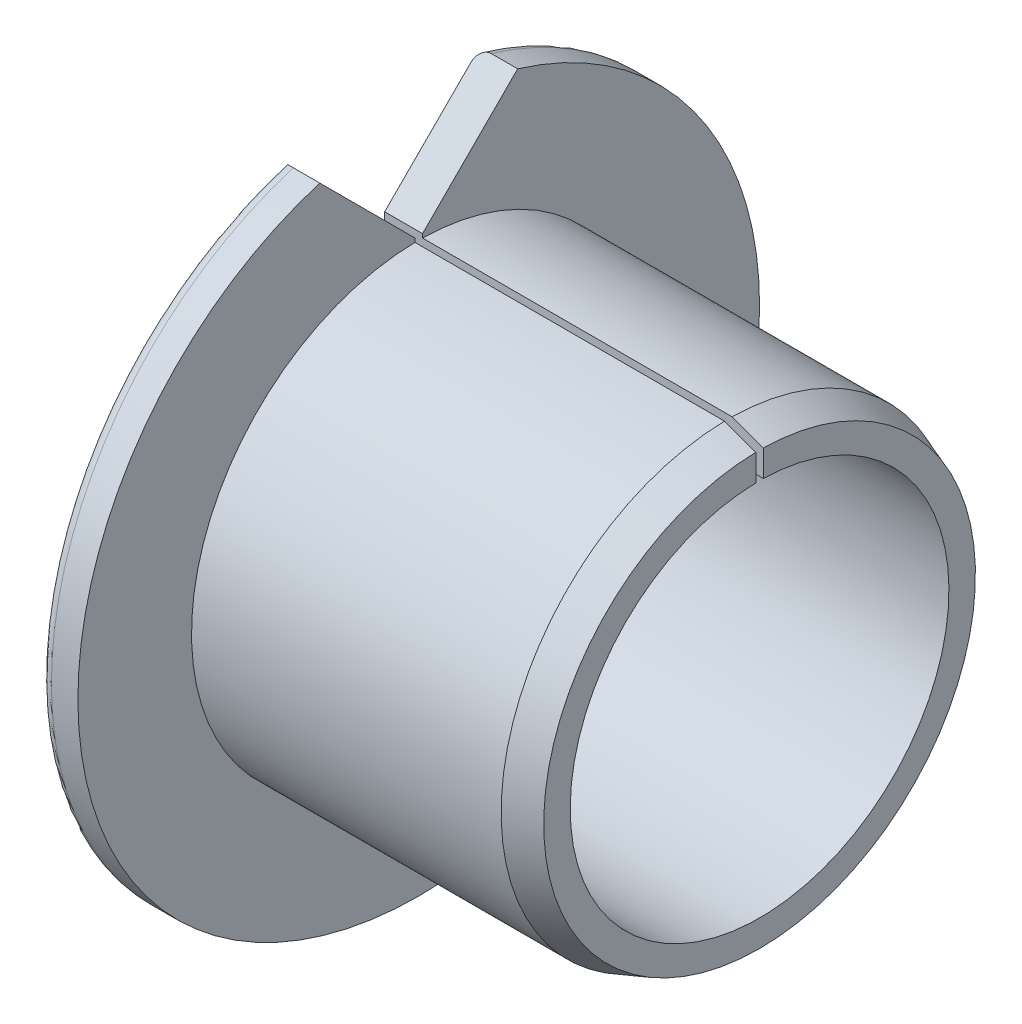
ISO-10303-21;
HEADER;
FILE_DESCRIPTION(('STEP AP214'),'2;1');
FILE_NAME('part.step','',(''),(''),'','','');
FILE_SCHEMA(('AUTOMOTIVE_DESIGN { 1 0 10303 214 1 1 1 1 }'));
ENDSEC;
DATA;
#1=APPLICATION_CONTEXT('core data for automotive mechanical design processes');
#2=APPLICATION_PROTOCOL_DEFINITION('international standard','automotive_design',2000,#1);
#3=PRODUCT_CONTEXT('',#1,'mechanical');
#4=PRODUCT('Part','Part','',(#3));
#5=PRODUCT_RELATED_PRODUCT_CATEGORY('part','',(#4));
#6=PRODUCT_DEFINITION_FORMATION('','',#4);
#7=PRODUCT_DEFINITION_CONTEXT('part definition',#1,'design');
#8=PRODUCT_DEFINITION('design','',#6,#7);
#9=PRODUCT_DEFINITION_SHAPE('','',#8);
#10=(LENGTH_UNIT() NAMED_UNIT(*) SI_UNIT(.MILLI.,.METRE.));
#11=(NAMED_UNIT(*) PLANE_ANGLE_UNIT() SI_UNIT($,.RADIAN.));
#12=(NAMED_UNIT(*) SI_UNIT($,.STERADIAN.) SOLID_ANGLE_UNIT());
#13=UNCERTAINTY_MEASURE_WITH_UNIT(LENGTH_MEASURE(1.E-05),#10,'distance_accuracy_value','');
#14=(GEOMETRIC_REPRESENTATION_CONTEXT(3) GLOBAL_UNCERTAINTY_ASSIGNED_CONTEXT((#13)) GLOBAL_UNIT_ASSIGNED_CONTEXT((#10,
#11,#12)) REPRESENTATION_CONTEXT('',''));
#15=CARTESIAN_POINT('',(0.,0.,0.));
#16=DIRECTION('',(0.,0.,1.));
#17=DIRECTION('',(1.,0.,0.));
#18=AXIS2_PLACEMENT_3D('',#15,#16,#17);
#19=CARTESIAN_POINT('',(7.,0.,0.));
#20=DIRECTION('',(-1.,0.,0.));
#21=DIRECTION('',(0.,0.,1.));
#22=AXIS2_PLACEMENT_3D('',#19,#20,#21);
#23=CYLINDRICAL_SURFACE('',#22,4.99999999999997);
#24=DIRECTION('',(-1.,0.,0.));
#25=VECTOR('',#24,1.);
#26=CARTESIAN_POINT('',(7.,4.99899989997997,0.1));
#27=LINE('',#26,#25);
#28=CARTESIAN_POINT('',(10.,4.99899989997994,0.1));
#29=VERTEX_POINT('',#28);
#30=CARTESIAN_POINT('',(0.,4.99899989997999,0.1));
#31=VERTEX_POINT('',#30);
#32=EDGE_CURVE('E112',#29,#31,#27,.T.);
#33=ORIENTED_EDGE('',*,*,#32,.F.);
#34=CARTESIAN_POINT('',(10.,0.,0.));
#35=DIRECTION('',(-1.,0.,0.));
#36=DIRECTION('',(0.,0.,1.));
#37=AXIS2_PLACEMENT_3D('',#34,#35,#36);
#38=CIRCLE('',#37,4.99999999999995);
#39=CARTESIAN_POINT('',(10.,4.99899989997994,-0.1));
#40=VERTEX_POINT('',#39);
#41=EDGE_CURVE('E234',#40,#29,#38,.T.);
#42=ORIENTED_EDGE('',*,*,#41,.F.);
#43=DIRECTION('',(-1.,0.,0.));
#44=VECTOR('',#43,1.);
#45=CARTESIAN_POINT('',(7.,4.99899989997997,-0.1));
#46=LINE('',#45,#44);
#47=CARTESIAN_POINT('',(0.,4.99899989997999,-0.1));
#48=VERTEX_POINT('',#47);
#49=EDGE_CURVE('E140',#48,#40,#46,.F.);
#50=ORIENTED_EDGE('',*,*,#49,.F.);
#51=CARTESIAN_POINT('',(0.,0.,0.));
#52=DIRECTION('',(-1.,0.,0.));
#53=DIRECTION('',(0.,0.,1.));
#54=AXIS2_PLACEMENT_3D('',#51,#52,#53);
#55=CIRCLE('',#54,5.);
#56=EDGE_CURVE('E133',#48,#31,#55,.T.);
#57=ORIENTED_EDGE('',*,*,#56,.T.);
#58=EDGE_LOOP('',(#33,#42,#50,#57));
#59=FACE_BOUND('',#58,.T.);
#60=ADVANCED_FACE('F33',(#59),#23,.F.);
#61=CARTESIAN_POINT('',(0.,5.,0.));
#62=DIRECTION('',(-1.,0.,0.));
#63=DIRECTION('',(0.,0.,1.));
#64=AXIS2_PLACEMENT_3D('',#61,#62,#63);
#65=PLANE('',#64);
#66=DIRECTION('',(0.,-0.707106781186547,0.707106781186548));
#67=VECTOR('',#66,1.);
#68=CARTESIAN_POINT('',(0.,5.5,0.5));
#69=LINE('',#68,#67);
#70=CARTESIAN_POINT('',(0.,8.37075413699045,-2.37075413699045));
#71=VERTEX_POINT('',#70);
#72=CARTESIAN_POINT('',(0.,6.1,-0.1));
#73=VERTEX_POINT('',#72);
#74=EDGE_CURVE('E250',#71,#73,#69,.T.);
#75=ORIENTED_EDGE('',*,*,#74,.F.);
#76=CARTESIAN_POINT('',(0.,0.,0.));
#77=DIRECTION('',(-1.,0.,0.));
#78=DIRECTION('',(0.,0.,1.));
#79=AXIS2_PLACEMENT_3D('',#76,#77,#78);
#80=CIRCLE('',#79,8.7);
#81=CARTESIAN_POINT('',(0.,8.37075413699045,2.37075413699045));
#82=VERTEX_POINT('',#81);
#83=EDGE_CURVE('E188',#71,#82,#80,.T.);
#84=ORIENTED_EDGE('',*,*,#83,.T.);
#85=DIRECTION('',(0.,0.707106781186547,0.707106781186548));
#86=VECTOR('',#85,1.);
#87=CARTESIAN_POINT('',(0.,5.5,-0.5));
#88=LINE('',#87,#86);
#89=CARTESIAN_POINT('',(0.,6.1,0.1));
#90=VERTEX_POINT('',#89);
#91=EDGE_CURVE('E135',#90,#82,#88,.T.);
#92=ORIENTED_EDGE('',*,*,#91,.F.);
#93=DIRECTION('',(0.,-1.,0.));
#94=VECTOR('',#93,1.);
#95=CARTESIAN_POINT('',(0.,6.2,0.1));
#96=LINE('',#95,#94);
#97=EDGE_CURVE('E116',#90,#31,#96,.T.);
#98=ORIENTED_EDGE('',*,*,#97,.T.);
#99=ORIENTED_EDGE('',*,*,#56,.F.);
#100=DIRECTION('',(0.,1.,0.));
#101=VECTOR('',#100,1.);
#102=CARTESIAN_POINT('',(0.,4.9,-0.1));
#103=LINE('',#102,#101);
#104=EDGE_CURVE('E136',#48,#73,#103,.T.);
#105=ORIENTED_EDGE('',*,*,#104,.T.);
#106=EDGE_LOOP('',(#75,#84,#92,#98,#99,#105));
#107=FACE_BOUND('',#106,.T.);
#108=ADVANCED_FACE('F131',(#107),#65,.T.);
#109=CARTESIAN_POINT('',(7.,0.,0.));
#110=DIRECTION('',(-1.,0.,0.));
#111=DIRECTION('',(0.,0.,1.));
#112=AXIS2_PLACEMENT_3D('',#109,#110,#111);
#113=CYLINDRICAL_SURFACE('',#112,9.);
#114=DIRECTION('',(-1.,0.,0.));
#115=VECTOR('',#114,1.);
#116=CARTESIAN_POINT('',(7.,8.61248608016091,2.61248608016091));
#117=LINE('',#116,#115);
#118=CARTESIAN_POINT('',(0.3,8.61248608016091,2.61248608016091));
#119=VERTEX_POINT('',#118);
#120=CARTESIAN_POINT('',(1.,8.61248608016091,2.61248608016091));
#121=VERTEX_POINT('',#120);
#122=EDGE_CURVE('E252',#119,#121,#117,.F.);
#123=ORIENTED_EDGE('',*,*,#122,.F.);
#124=CARTESIAN_POINT('',(0.3,0.,0.));
#125=DIRECTION('',(-1.,0.,0.));
#126=DIRECTION('',(0.,0.,1.));
#127=AXIS2_PLACEMENT_3D('',#124,#125,#126);
#128=CIRCLE('',#127,9.);
#129=CARTESIAN_POINT('',(0.3,8.61248608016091,-2.61248608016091));
#130=VERTEX_POINT('',#129);
#131=EDGE_CURVE('E45',#119,#130,#128,.F.);
#132=ORIENTED_EDGE('',*,*,#131,.T.);
#133=DIRECTION('',(-1.,0.,0.));
#134=VECTOR('',#133,1.);
#135=CARTESIAN_POINT('',(7.,8.61248608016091,-2.61248608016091));
#136=LINE('',#135,#134);
#137=CARTESIAN_POINT('',(1.,8.61248608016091,-2.61248608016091));
#138=VERTEX_POINT('',#137);
#139=EDGE_CURVE('E248',#138,#130,#136,.T.);
#140=ORIENTED_EDGE('',*,*,#139,.F.);
#141=CARTESIAN_POINT('',(1.,0.,0.));
#142=DIRECTION('',(-1.,0.,0.));
#143=DIRECTION('',(0.,0.,1.));
#144=AXIS2_PLACEMENT_3D('',#141,#142,#143);
#145=CIRCLE('',#144,9.);
#146=EDGE_CURVE('E142',#138,#121,#145,.T.);
#147=ORIENTED_EDGE('',*,*,#146,.T.);
#148=EDGE_LOOP('',(#123,#132,#140,#147));
#149=FACE_BOUND('',#148,.T.);
#150=ADVANCED_FACE('F203',(#149),#113,.T.);
#151=CARTESIAN_POINT('',(1.,9.,0.));
#152=DIRECTION('',(1.,0.,0.));
#153=DIRECTION('',(0.,0.,-1.));
#154=AXIS2_PLACEMENT_3D('',#151,#152,#153);
#155=PLANE('',#154);
#156=DIRECTION('',(0.,-1.,0.));
#157=VECTOR('',#156,1.);
#158=CARTESIAN_POINT('',(1.,9.,0.1));
#159=LINE('',#158,#157);
#160=CARTESIAN_POINT('',(1.,6.1,0.1));
#161=VERTEX_POINT('',#160);
#162=CARTESIAN_POINT('',(1.,5.99916660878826,0.1));
#163=VERTEX_POINT('',#162);
#164=EDGE_CURVE('E241',#161,#163,#159,.T.);
#165=ORIENTED_EDGE('',*,*,#164,.F.);
#166=DIRECTION('',(0.,-0.707106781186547,-0.707106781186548));
#167=VECTOR('',#166,1.);
#168=CARTESIAN_POINT('',(1.,9.5,3.5));
#169=LINE('',#168,#167);
#170=EDGE_CURVE('E124',#121,#161,#169,.T.);
#171=ORIENTED_EDGE('',*,*,#170,.F.);
#172=ORIENTED_EDGE('',*,*,#146,.F.);
#173=DIRECTION('',(0.,0.707106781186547,-0.707106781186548));
#174=VECTOR('',#173,1.);
#175=CARTESIAN_POINT('',(1.,6.,0.));
#176=LINE('',#175,#174);
#177=CARTESIAN_POINT('',(1.,6.1,-0.1));
#178=VERTEX_POINT('',#177);
#179=EDGE_CURVE('E246',#178,#138,#176,.T.);
#180=ORIENTED_EDGE('',*,*,#179,.F.);
#181=DIRECTION('',(0.,1.,0.));
#182=VECTOR('',#181,1.);
#183=CARTESIAN_POINT('',(1.,9.,-0.1));
#184=LINE('',#183,#182);
#185=CARTESIAN_POINT('',(1.,5.99916660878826,-0.1));
#186=VERTEX_POINT('',#185);
#187=EDGE_CURVE('E227',#186,#178,#184,.T.);
#188=ORIENTED_EDGE('',*,*,#187,.F.);
#189=CARTESIAN_POINT('',(1.,0.,0.));
#190=DIRECTION('',(-1.,0.,0.));
#191=DIRECTION('',(0.,0.,1.));
#192=AXIS2_PLACEMENT_3D('',#189,#190,#191);
#193=CIRCLE('',#192,6.);
#194=EDGE_CURVE('E148',#186,#163,#193,.T.);
#195=ORIENTED_EDGE('',*,*,#194,.T.);
#196=EDGE_LOOP('',(#165,#171,#172,#180,#188,#195));
#197=FACE_BOUND('',#196,.T.);
#198=ADVANCED_FACE('F207',(#197),#155,.T.);
#199=CARTESIAN_POINT('',(7.,0.,0.));
#200=DIRECTION('',(-1.,0.,0.));
#201=DIRECTION('',(0.,0.,1.));
#202=AXIS2_PLACEMENT_3D('',#199,#200,#201);
#203=CYLINDRICAL_SURFACE('',#202,6.);
#204=DIRECTION('',(-1.,0.,0.));
#205=VECTOR('',#204,1.);
#206=CARTESIAN_POINT('',(7.,5.99916660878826,-0.1));
#207=LINE('',#206,#205);
#208=CARTESIAN_POINT('',(9.17575677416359,5.99916660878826,-0.1));
#209=VERTEX_POINT('',#208);
#210=EDGE_CURVE('E221',#209,#186,#207,.T.);
#211=ORIENTED_EDGE('',*,*,#210,.F.);
#212=CARTESIAN_POINT('',(9.17575677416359,0.,0.));
#213=DIRECTION('',(1.,0.,0.));
#214=DIRECTION('',(0.,0.,-1.));
#215=AXIS2_PLACEMENT_3D('',#212,#213,#214);
#216=CIRCLE('',#215,6.);
#217=CARTESIAN_POINT('',(9.17575677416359,5.99916660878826,0.1));
#218=VERTEX_POINT('',#217);
#219=EDGE_CURVE('E153',#209,#218,#216,.F.);
#220=ORIENTED_EDGE('',*,*,#219,.T.);
#221=DIRECTION('',(-1.,0.,0.));
#222=VECTOR('',#221,1.);
#223=CARTESIAN_POINT('',(7.,5.99916660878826,0.1));
#224=LINE('',#223,#222);
#225=EDGE_CURVE('E125',#163,#218,#224,.F.);
#226=ORIENTED_EDGE('',*,*,#225,.F.);
#227=ORIENTED_EDGE('',*,*,#194,.F.);
#228=EDGE_LOOP('',(#211,#220,#226,#227));
#229=FACE_BOUND('',#228,.T.);
#230=ADVANCED_FACE('F211',(#229),#203,.T.);
#231=CARTESIAN_POINT('',(10.,6.,0.));
#232=DIRECTION('',(1.,0.,0.));
#233=DIRECTION('',(0.,0.,-1.));
#234=AXIS2_PLACEMENT_3D('',#231,#232,#233);
#235=PLANE('',#234);
#236=DIRECTION('',(0.,-1.,0.));
#237=VECTOR('',#236,1.);
#238=CARTESIAN_POINT('',(10.,6.2,0.1));
#239=LINE('',#238,#237);
#240=CARTESIAN_POINT('',(10.,5.69912273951,0.1));
#241=VERTEX_POINT('',#240);
#242=EDGE_CURVE('E119',#241,#29,#239,.T.);
#243=ORIENTED_EDGE('',*,*,#242,.F.);
#244=CARTESIAN_POINT('',(10.,0.,0.));
#245=DIRECTION('',(1.,0.,0.));
#246=DIRECTION('',(0.,0.,-1.));
#247=AXIS2_PLACEMENT_3D('',#244,#245,#246);
#248=CIRCLE('',#247,5.69999999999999);
#249=CARTESIAN_POINT('',(10.,5.69912273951,-0.1));
#250=VERTEX_POINT('',#249);
#251=EDGE_CURVE('E163',#241,#250,#248,.T.);
#252=ORIENTED_EDGE('',*,*,#251,.T.);
#253=DIRECTION('',(0.,1.,0.));
#254=VECTOR('',#253,1.);
#255=CARTESIAN_POINT('',(10.,4.9,-0.1));
#256=LINE('',#255,#254);
#257=EDGE_CURVE('E137',#40,#250,#256,.T.);
#258=ORIENTED_EDGE('',*,*,#257,.F.);
#259=ORIENTED_EDGE('',*,*,#41,.T.);
#260=EDGE_LOOP('',(#243,#252,#258,#259));
#261=FACE_BOUND('',#260,.T.);
#262=ADVANCED_FACE('F181',(#261),#235,.T.);
#263=CARTESIAN_POINT('',(-9.,9.5,3.5));
#264=DIRECTION('',(0.,-0.707106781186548,0.707106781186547));
#265=DIRECTION('',(0.,-0.707106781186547,-0.707106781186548));
#266=AXIS2_PLACEMENT_3D('',#263,#264,#265);
#267=PLANE('',#266);
#268=ORIENTED_EDGE('',*,*,#91,.T.);
#269=CARTESIAN_POINT('',(0.,8.37075413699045,2.37075413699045));
#270=CARTESIAN_POINT('',(-4.1976129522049E-06,8.38589873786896,2.38589873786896));
#271=CARTESIAN_POINT('',(0.00174871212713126,8.40105516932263,2.40105516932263));
#272=CARTESIAN_POINT('',(0.00878412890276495,8.43102023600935,2.43102023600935));
#273=CARTESIAN_POINT('',(0.0140823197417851,8.44582702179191,2.44582702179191));
#274=CARTESIAN_POINT('',(0.0282396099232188,8.47461079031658,2.47461079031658));
#275=CARTESIAN_POINT('',(0.0371066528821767,8.48858584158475,2.48858584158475));
#276=CARTESIAN_POINT('',(0.0583189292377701,8.51513175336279,2.51513175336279));
#277=CARTESIAN_POINT('',(0.0706580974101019,8.52770500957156,2.52770500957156));
#278=CARTESIAN_POINT('',(0.0974261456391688,8.54990283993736,2.54990283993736));
#279=CARTESIAN_POINT('',(0.111589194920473,8.55968702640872,2.55968702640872));
#280=CARTESIAN_POINT('',(0.142349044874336,8.57712707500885,2.57712707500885));
#281=CARTESIAN_POINT('',(0.158944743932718,8.58478389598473,2.58478389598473));
#282=CARTESIAN_POINT('',(0.191716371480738,8.59666771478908,2.59666771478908));
#283=CARTESIAN_POINT('',(0.207662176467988,8.60121273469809,2.60121273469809));
#284=CARTESIAN_POINT('',(0.240453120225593,8.60808822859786,2.60808822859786));
#285=CARTESIAN_POINT('',(0.257295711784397,8.61042465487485,2.61042465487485));
#286=CARTESIAN_POINT('',(0.282832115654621,8.61219248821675,2.61219248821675));
#287=CARTESIAN_POINT('',(0.291418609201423,8.61249036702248,2.61249036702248));
#288=CARTESIAN_POINT('',(0.3,8.61248608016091,2.61248608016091));
#289=B_SPLINE_CURVE_WITH_KNOTS('',3,(#269,#270,#271,#272,#273,#274,#275,#276,#277,#278,#279,
#280,#281,#282,#283,#284,#285,#286,#287,#288),.UNSPECIFIED.,.F.,.F.,(4,2,2,2,2,2,2,2,2,4),(0.,
0.0642092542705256,0.128704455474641,0.193344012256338,0.257871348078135,0.316928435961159,
0.375958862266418,0.427251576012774,0.478405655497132,0.504154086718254),.UNSPECIFIED.);
#290=EDGE_CURVE('E59',#82,#119,#289,.T.);
#291=ORIENTED_EDGE('',*,*,#290,.T.);
#292=ORIENTED_EDGE('',*,*,#122,.T.);
#293=ORIENTED_EDGE('',*,*,#170,.T.);
#294=DIRECTION('',(-1.,0.,0.));
#295=VECTOR('',#294,1.);
#296=CARTESIAN_POINT('',(-9.,6.1,0.1));
#297=LINE('',#296,#295);
#298=EDGE_CURVE('E145',#161,#90,#297,.T.);
#299=ORIENTED_EDGE('',*,*,#298,.T.);
#300=EDGE_LOOP('',(#268,#291,#292,#293,#299));
#301=FACE_BOUND('',#300,.T.);
#302=ADVANCED_FACE('F176',(#301),#267,.F.);
#303=CARTESIAN_POINT('',(-9.,6.,0.));
#304=DIRECTION('',(0.,-0.707106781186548,-0.707106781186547));
#305=DIRECTION('',(0.,0.707106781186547,-0.707106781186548));
#306=AXIS2_PLACEMENT_3D('',#303,#304,#305);
#307=PLANE('',#306);
#308=ORIENTED_EDGE('',*,*,#139,.T.);
#309=CARTESIAN_POINT('',(0.3,8.61248608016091,-2.61248608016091));
#310=CARTESIAN_POINT('',(0.284559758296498,8.61250147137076,-2.61250147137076));
#311=CARTESIAN_POINT('',(0.269134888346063,8.61153145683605,-2.61153145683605));
#312=CARTESIAN_POINT('',(0.238804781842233,8.60774400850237,-2.60774400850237));
#313=CARTESIAN_POINT('',(0.223897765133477,8.60493373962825,-2.60493373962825));
#314=CARTESIAN_POINT('',(0.194975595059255,8.59758988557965,-2.59758988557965));
#315=CARTESIAN_POINT('',(0.180959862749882,8.59305743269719,-2.59305743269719));
#316=CARTESIAN_POINT('',(0.154132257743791,8.58246277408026,-2.58246277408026));
#317=CARTESIAN_POINT('',(0.141321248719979,8.57639948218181,-2.57639948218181));
#318=CARTESIAN_POINT('',(0.116613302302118,8.56266170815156,-2.56266170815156));
#319=CARTESIAN_POINT('',(0.104783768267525,8.55492683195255,-2.55492683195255));
#320=CARTESIAN_POINT('',(0.0829061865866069,8.53829149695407,-2.53829149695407));
#321=CARTESIAN_POINT('',(0.0728584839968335,8.52939081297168,-2.52939081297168));
#322=CARTESIAN_POINT('',(0.0536358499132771,8.50962476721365,-2.50962476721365));
#323=CARTESIAN_POINT('',(0.044684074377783,8.49865100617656,-2.49865100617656));
#324=CARTESIAN_POINT('',(0.029189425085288,8.47587625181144,-2.47587625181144));
#325=CARTESIAN_POINT('',(0.0226491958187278,8.46407436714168,-2.46407436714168));
#326=CARTESIAN_POINT('',(0.0115453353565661,8.43886582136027,-2.43886582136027));
#327=CARTESIAN_POINT('',(0.00720760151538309,8.42540953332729,-2.42540953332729));
#328=CARTESIAN_POINT('',(0.00143632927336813,8.39821668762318,-2.39821668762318));
#329=CARTESIAN_POINT('',(-3.26207527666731E-06,8.38448077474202,-2.38448077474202));
#330=CARTESIAN_POINT('',(0.,8.37075413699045,-2.37075413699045));
#331=B_SPLINE_CURVE_WITH_KNOTS('',3,(#309,#310,#311,#312,#313,#314,#315,#316,#317,#318,#319,
#320,#321,#322,#323,#324,#325,#326,#327,#328,#329,#330),.UNSPECIFIED.,.F.,.F.,(4,2,2,2,2,2,2,2,
2,2,4),(0.,0.0462358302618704,0.0922927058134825,0.138319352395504,0.184378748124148,
0.232518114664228,0.280666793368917,0.334198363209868,0.387788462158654,0.446116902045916,
0.504323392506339),.UNSPECIFIED.);
#332=EDGE_CURVE('E11',#130,#71,#331,.T.);
#333=ORIENTED_EDGE('',*,*,#332,.T.);
#334=ORIENTED_EDGE('',*,*,#74,.T.);
#335=DIRECTION('',(1.,0.,0.));
#336=VECTOR('',#335,1.);
#337=CARTESIAN_POINT('',(-9.,6.1,-0.1));
#338=LINE('',#337,#336);
#339=EDGE_CURVE('E141',#73,#178,#338,.T.);
#340=ORIENTED_EDGE('',*,*,#339,.T.);
#341=ORIENTED_EDGE('',*,*,#179,.T.);
#342=EDGE_LOOP('',(#308,#333,#334,#340,#341));
#343=FACE_BOUND('',#342,.T.);
#344=ADVANCED_FACE('F172',(#343),#307,.F.);
#345=CARTESIAN_POINT('',(0.,4.9,-0.1));
#346=DIRECTION('',(0.,0.,-1.));
#347=DIRECTION('',(-1.,0.,0.));
#348=AXIS2_PLACEMENT_3D('',#345,#346,#347);
#349=PLANE('',#348);
#350=ORIENTED_EDGE('',*,*,#257,.T.);
#351=CARTESIAN_POINT('',(10.,5.69912273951,-0.1));
#352=CARTESIAN_POINT('',(9.86262624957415,5.74913038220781,-0.1));
#353=CARTESIAN_POINT('',(9.72525243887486,5.79913785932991,-0.1));
#354=CARTESIAN_POINT('',(9.45050469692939,5.89915248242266,-0.1));
#355=CARTESIAN_POINT('',(9.31313076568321,5.94915962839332,-0.1));
#356=CARTESIAN_POINT('',(9.17575677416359,5.99916660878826,-0.1));
#357=B_SPLINE_CURVE_WITH_KNOTS('',3,(#351,#352,#353,#354,#355,#356),.UNSPECIFIED.,.F.,.F.,(4,2,
4),(0.,0.438578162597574,0.877156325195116),.UNSPECIFIED.);
#358=EDGE_CURVE('E231',#250,#209,#357,.T.);
#359=ORIENTED_EDGE('',*,*,#358,.T.);
#360=ORIENTED_EDGE('',*,*,#210,.T.);
#361=ORIENTED_EDGE('',*,*,#187,.T.);
#362=ORIENTED_EDGE('',*,*,#339,.F.);
#363=ORIENTED_EDGE('',*,*,#104,.F.);
#364=ORIENTED_EDGE('',*,*,#49,.T.);
#365=EDGE_LOOP('',(#350,#359,#360,#361,#362,#363,#364));
#366=FACE_BOUND('',#365,.T.);
#367=ADVANCED_FACE('F170',(#366),#349,.F.);
#368=CARTESIAN_POINT('',(0.,6.2,0.1));
#369=DIRECTION('',(0.,0.,1.));
#370=DIRECTION('',(1.,0.,0.));
#371=AXIS2_PLACEMENT_3D('',#368,#369,#370);
#372=PLANE('',#371);
#373=ORIENTED_EDGE('',*,*,#225,.T.);
#374=CARTESIAN_POINT('',(9.17575677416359,5.99916660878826,0.1));
#375=CARTESIAN_POINT('',(9.31313076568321,5.94915962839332,0.1));
#376=CARTESIAN_POINT('',(9.45050469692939,5.89915248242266,0.1));
#377=CARTESIAN_POINT('',(9.72525243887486,5.79913785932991,0.1));
#378=CARTESIAN_POINT('',(9.86262624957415,5.74913038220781,0.1));
#379=CARTESIAN_POINT('',(10.,5.69912273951,0.1));
#380=B_SPLINE_CURVE_WITH_KNOTS('',3,(#374,#375,#376,#377,#378,#379),.UNSPECIFIED.,.F.,.F.,(4,2,
4),(0.,0.438578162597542,0.877156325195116),.UNSPECIFIED.);
#381=EDGE_CURVE('E156',#218,#241,#380,.T.);
#382=ORIENTED_EDGE('',*,*,#381,.T.);
#383=ORIENTED_EDGE('',*,*,#242,.T.);
#384=ORIENTED_EDGE('',*,*,#32,.T.);
#385=ORIENTED_EDGE('',*,*,#97,.F.);
#386=ORIENTED_EDGE('',*,*,#298,.F.);
#387=ORIENTED_EDGE('',*,*,#164,.T.);
#388=EDGE_LOOP('',(#373,#382,#383,#384,#385,#386,#387));
#389=FACE_BOUND('',#388,.T.);
#390=ADVANCED_FACE('F115',(#389),#372,.F.);
#391=CARTESIAN_POINT('',(9.17575677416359,0.,0.));
#392=DIRECTION('',(-1.,0.,0.));
#393=DIRECTION('',(0.,0.,1.));
#394=AXIS2_PLACEMENT_3D('',#391,#392,#393);
#395=CONICAL_SURFACE('',#394,6.,0.349065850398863);
#396=ORIENTED_EDGE('',*,*,#358,.F.);
#397=ORIENTED_EDGE('',*,*,#251,.F.);
#398=ORIENTED_EDGE('',*,*,#381,.F.);
#399=ORIENTED_EDGE('',*,*,#219,.F.);
#400=EDGE_LOOP('',(#396,#397,#398,#399));
#401=FACE_BOUND('',#400,.T.);
#402=ADVANCED_FACE('F165',(#401),#395,.T.);
#403=CARTESIAN_POINT('',(0.3,0.,0.));
#404=DIRECTION('',(-1.,0.,0.));
#405=DIRECTION('',(0.,0.,1.));
#406=AXIS2_PLACEMENT_3D('',#403,#404,#405);
#407=TOROIDAL_SURFACE('',#406,8.7,0.3);
#408=ORIENTED_EDGE('',*,*,#332,.F.);
#409=ORIENTED_EDGE('',*,*,#131,.F.);
#410=ORIENTED_EDGE('',*,*,#290,.F.);
#411=ORIENTED_EDGE('',*,*,#83,.F.);
#412=EDGE_LOOP('',(#408,#409,#410,#411));
#413=FACE_BOUND('',#412,.T.);
#414=ADVANCED_FACE('F189',(#413),#407,.T.);
#415=CLOSED_SHELL('',(#60,#108,#150,#198,#230,#262,#302,#344,#367,#390,#402,#414));
#416=MANIFOLD_SOLID_BREP('B2',#415);
#417=ADVANCED_BREP_SHAPE_REPRESENTATION('',(#18,#416),#14);
#418=SHAPE_DEFINITION_REPRESENTATION(#9,#417);
ENDSEC;
END-ISO-10303-21;
